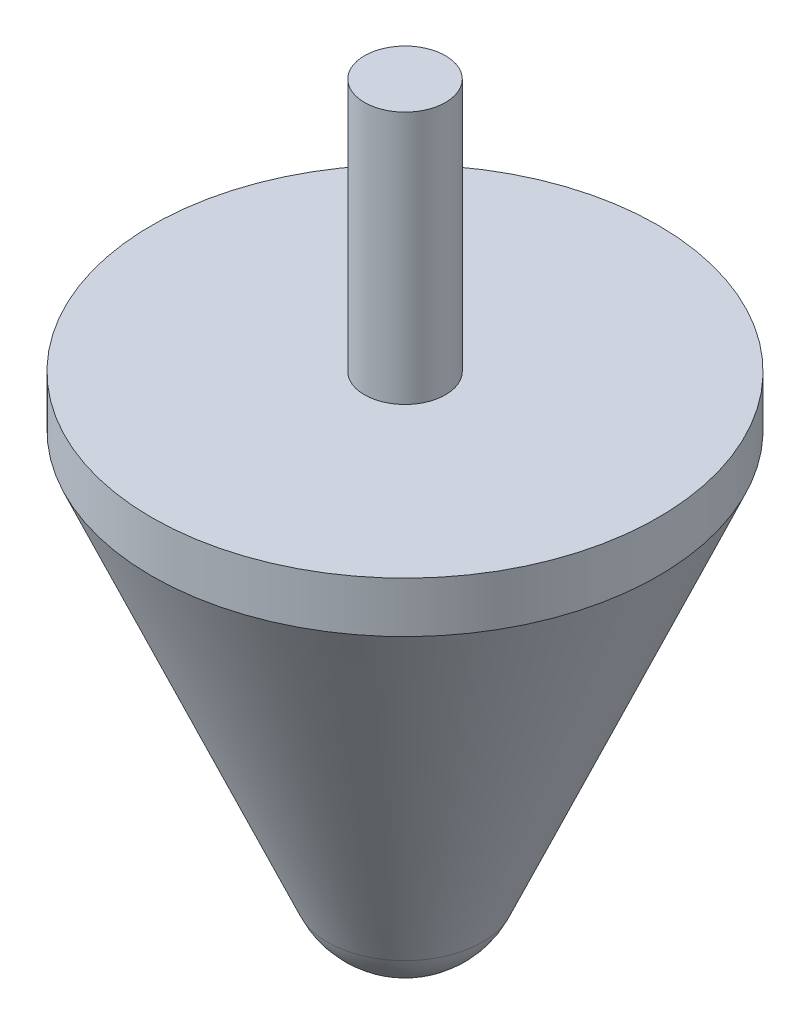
ISO-10303-21;
HEADER;
FILE_DESCRIPTION(('STEP AP214'),'2;1');
FILE_NAME('part.step','',(''),(''),'','','');
FILE_SCHEMA(('AUTOMOTIVE_DESIGN { 1 0 10303 214 1 1 1 1 }'));
ENDSEC;
DATA;
#1=APPLICATION_CONTEXT('core data for automotive mechanical design processes');
#2=APPLICATION_PROTOCOL_DEFINITION('international standard','automotive_design',2000,#1);
#3=PRODUCT_CONTEXT('',#1,'mechanical');
#4=PRODUCT('Part','Part','',(#3));
#5=PRODUCT_RELATED_PRODUCT_CATEGORY('part','',(#4));
#6=PRODUCT_DEFINITION_FORMATION('','',#4);
#7=PRODUCT_DEFINITION_CONTEXT('part definition',#1,'design');
#8=PRODUCT_DEFINITION('design','',#6,#7);
#9=PRODUCT_DEFINITION_SHAPE('','',#8);
#10=(LENGTH_UNIT() NAMED_UNIT(*) SI_UNIT(.MILLI.,.METRE.));
#11=(NAMED_UNIT(*) PLANE_ANGLE_UNIT() SI_UNIT($,.RADIAN.));
#12=(NAMED_UNIT(*) SI_UNIT($,.STERADIAN.) SOLID_ANGLE_UNIT());
#13=UNCERTAINTY_MEASURE_WITH_UNIT(LENGTH_MEASURE(1.E-05),#10,'distance_accuracy_value','');
#14=(GEOMETRIC_REPRESENTATION_CONTEXT(3) GLOBAL_UNCERTAINTY_ASSIGNED_CONTEXT((#13)) GLOBAL_UNIT_ASSIGNED_CONTEXT((#10,
#11,#12)) REPRESENTATION_CONTEXT('',''));
#15=CARTESIAN_POINT('',(0.,0.,0.));
#16=DIRECTION('',(0.,0.,1.));
#17=DIRECTION('',(1.,0.,0.));
#18=AXIS2_PLACEMENT_3D('',#15,#16,#17);
#19=CARTESIAN_POINT('',(2.49999999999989,75.,0.));
#20=DIRECTION('',(0.,1.,0.));
#21=DIRECTION('',(0.,0.,0.999999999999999));
#22=AXIS2_PLACEMENT_3D('',#19,#20,#21);
#23=PLANE('',#22);
#24=CARTESIAN_POINT('',(-1.11022302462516E-13,75.,1.11022302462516E-13));
#25=DIRECTION('',(0.,1.,0.));
#26=DIRECTION('',(0.,0.,0.999999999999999));
#27=AXIS2_PLACEMENT_3D('',#24,#25,#26);
#28=CIRCLE('',#27,4.);
#29=CARTESIAN_POINT('',(-1.1230124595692E-13,75.,4.0000000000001));
#30=VERTEX_POINT('',#29);
#31=EDGE_CURVE('E29',#30,#30,#28,.F.);
#32=ORIENTED_EDGE('',*,*,#31,.F.);
#33=EDGE_LOOP('',(#32));
#34=FACE_BOUND('',#33,.T.);
#35=ADVANCED_FACE('F25',(#34),#23,.T.);
#36=CARTESIAN_POINT('',(-1.11022302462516E-13,-25.1575911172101,1.11022302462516E-13));
#37=DIRECTION('',(0.,1.,0.));
#38=DIRECTION('',(0.,0.,0.999999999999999));
#39=AXIS2_PLACEMENT_3D('',#36,#37,#38);
#40=CYLINDRICAL_SURFACE('',#39,4.);
#41=CARTESIAN_POINT('',(0.,49.9999999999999,0.));
#42=DIRECTION('',(0.,1.,0.));
#43=DIRECTION('',(0.,0.,0.999999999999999));
#44=AXIS2_PLACEMENT_3D('',#41,#42,#43);
#45=CIRCLE('',#44,4.);
#46=CARTESIAN_POINT('',(-1.11954301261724E-13,49.9999999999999,4.0000000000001));
#47=VERTEX_POINT('',#46);
#48=EDGE_CURVE('E42',#47,#47,#45,.F.);
#49=CARTESIAN_POINT('',(-1.1230124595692E-13,75.,4.0000000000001));
#50=CARTESIAN_POINT('',(-1.12297631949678E-13,74.7395833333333,4.0000000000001));
#51=CARTESIAN_POINT('',(-1.12294017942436E-13,74.4791666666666,4.0000000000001));
#52=CARTESIAN_POINT('',(-1.12286789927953E-13,73.9583333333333,4.0000000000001));
#53=CARTESIAN_POINT('',(-1.12283175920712E-13,73.6979166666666,4.0000000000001));
#54=CARTESIAN_POINT('',(-1.12275947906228E-13,73.1770833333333,4.0000000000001));
#55=CARTESIAN_POINT('',(-1.12272333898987E-13,72.9166666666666,4.0000000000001));
#56=CARTESIAN_POINT('',(-1.12265105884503E-13,72.3958333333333,4.0000000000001));
#57=CARTESIAN_POINT('',(-1.12261491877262E-13,72.1354166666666,4.0000000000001));
#58=CARTESIAN_POINT('',(-1.12254263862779E-13,71.6145833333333,4.0000000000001));
#59=CARTESIAN_POINT('',(-1.12250649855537E-13,71.3541666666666,4.0000000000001));
#60=CARTESIAN_POINT('',(-1.12243421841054E-13,70.8333333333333,4.0000000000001));
#61=CARTESIAN_POINT('',(-1.12239807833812E-13,70.5729166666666,4.0000000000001));
#62=CARTESIAN_POINT('',(-1.12232579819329E-13,70.0520833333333,4.0000000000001));
#63=CARTESIAN_POINT('',(-1.12228965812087E-13,69.7916666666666,4.0000000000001));
#64=CARTESIAN_POINT('',(-1.12221737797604E-13,69.2708333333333,4.0000000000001));
#65=CARTESIAN_POINT('',(-1.12218123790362E-13,69.0104166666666,4.0000000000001));
#66=CARTESIAN_POINT('',(-1.12210895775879E-13,68.4895833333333,4.0000000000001));
#67=CARTESIAN_POINT('',(-1.12207281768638E-13,68.2291666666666,4.0000000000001));
#68=CARTESIAN_POINT('',(-1.12200053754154E-13,67.7083333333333,4.0000000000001));
#69=CARTESIAN_POINT('',(-1.12196439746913E-13,67.4479166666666,4.0000000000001));
#70=CARTESIAN_POINT('',(-1.12189211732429E-13,66.9270833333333,4.0000000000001));
#71=CARTESIAN_POINT('',(-1.12185597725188E-13,66.6666666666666,4.0000000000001));
#72=CARTESIAN_POINT('',(-1.12178369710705E-13,66.1458333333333,4.0000000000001));
#73=CARTESIAN_POINT('',(-1.12174755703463E-13,65.8854166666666,4.0000000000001));
#74=CARTESIAN_POINT('',(-1.1216752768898E-13,65.3645833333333,4.0000000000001));
#75=CARTESIAN_POINT('',(-1.12163913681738E-13,65.1041666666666,4.0000000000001));
#76=CARTESIAN_POINT('',(-1.12156685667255E-13,64.5833333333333,4.0000000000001));
#77=CARTESIAN_POINT('',(-1.12153071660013E-13,64.3229166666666,4.0000000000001));
#78=CARTESIAN_POINT('',(-1.1214584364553E-13,63.8020833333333,4.0000000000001));
#79=CARTESIAN_POINT('',(-1.12142229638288E-13,63.5416666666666,4.0000000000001));
#80=CARTESIAN_POINT('',(-1.12135001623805E-13,63.0208333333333,4.0000000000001));
#81=CARTESIAN_POINT('',(-1.12131387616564E-13,62.7604166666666,4.0000000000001));
#82=CARTESIAN_POINT('',(-1.1212415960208E-13,62.2395833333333,4.0000000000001));
#83=CARTESIAN_POINT('',(-1.12120545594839E-13,61.9791666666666,4.0000000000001));
#84=CARTESIAN_POINT('',(-1.12113317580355E-13,61.4583333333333,4.0000000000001));
#85=CARTESIAN_POINT('',(-1.12109703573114E-13,61.1979166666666,4.0000000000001));
#86=CARTESIAN_POINT('',(-1.12102475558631E-13,60.6770833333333,4.0000000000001));
#87=CARTESIAN_POINT('',(-1.12098861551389E-13,60.4166666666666,4.0000000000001));
#88=CARTESIAN_POINT('',(-1.12091633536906E-13,59.8958333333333,4.0000000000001));
#89=CARTESIAN_POINT('',(-1.12088019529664E-13,59.6354166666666,4.0000000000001));
#90=CARTESIAN_POINT('',(-1.12080791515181E-13,59.1145833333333,4.0000000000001));
#91=CARTESIAN_POINT('',(-1.12077177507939E-13,58.8541666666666,4.0000000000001));
#92=CARTESIAN_POINT('',(-1.12069949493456E-13,58.3333333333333,4.0000000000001));
#93=CARTESIAN_POINT('',(-1.12066335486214E-13,58.0729166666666,4.0000000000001));
#94=CARTESIAN_POINT('',(-1.12059107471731E-13,57.5520833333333,4.0000000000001));
#95=CARTESIAN_POINT('',(-1.1205549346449E-13,57.2916666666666,4.0000000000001));
#96=CARTESIAN_POINT('',(-1.12048265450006E-13,56.7708333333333,4.0000000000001));
#97=CARTESIAN_POINT('',(-1.12044651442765E-13,56.5104166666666,4.0000000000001));
#98=CARTESIAN_POINT('',(-1.12037423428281E-13,55.9895833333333,4.0000000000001));
#99=CARTESIAN_POINT('',(-1.1203380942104E-13,55.7291666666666,4.0000000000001));
#100=CARTESIAN_POINT('',(-1.12026581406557E-13,55.2083333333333,4.0000000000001));
#101=CARTESIAN_POINT('',(-1.12022967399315E-13,54.9479166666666,4.0000000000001));
#102=CARTESIAN_POINT('',(-1.12015739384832E-13,54.4270833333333,4.0000000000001));
#103=CARTESIAN_POINT('',(-1.1201212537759E-13,54.1666666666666,4.0000000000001));
#104=CARTESIAN_POINT('',(-1.12004897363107E-13,53.6458333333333,4.0000000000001));
#105=CARTESIAN_POINT('',(-1.12001283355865E-13,53.3854166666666,4.0000000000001));
#106=CARTESIAN_POINT('',(-1.11994055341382E-13,52.8645833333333,4.0000000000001));
#107=CARTESIAN_POINT('',(-1.1199044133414E-13,52.6041666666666,4.0000000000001));
#108=CARTESIAN_POINT('',(-1.11983213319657E-13,52.0833333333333,4.0000000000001));
#109=CARTESIAN_POINT('',(-1.11979599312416E-13,51.8229166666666,4.0000000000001));
#110=CARTESIAN_POINT('',(-1.11972371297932E-13,51.3020833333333,4.0000000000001));
#111=CARTESIAN_POINT('',(-1.11968757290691E-13,51.0416666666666,4.0000000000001));
#112=CARTESIAN_POINT('',(-1.11961529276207E-13,50.5208333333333,4.0000000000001));
#113=CARTESIAN_POINT('',(-1.11957915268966E-13,50.2604166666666,4.0000000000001));
#114=CARTESIAN_POINT('',(-1.11954301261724E-13,49.9999999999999,4.0000000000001));
#115=B_SPLINE_CURVE_WITH_KNOTS('',3,(#49,#50,#51,#52,#53,#54,#55,#56,#57,#58,#59,#60,#61,#62,
#63,#64,#65,#66,#67,#68,#69,#70,#71,#72,#73,#74,#75,#76,#77,#78,#79,#80,#81,#82,#83,#84,#85,#86,
#87,#88,#89,#90,#91,#92,#93,#94,#95,#96,#97,#98,#99,#100,#101,#102,#103,#104,#105,#106,#107,
#108,#109,#110,#111,#112,#113,#114),.UNSPECIFIED.,.F.,.F.,(4,2,2,2,2,2,2,2,2,2,2,2,2,2,2,2,2,2,
2,2,2,2,2,2,2,2,2,2,2,2,2,2,4),(0.,0.781249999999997,1.56250000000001,2.34375000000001,3.125,
3.90625000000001,4.68750000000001,5.46875000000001,6.25000000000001,7.03125000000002,
7.81250000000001,8.59375000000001,9.37500000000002,10.15625,10.9375,11.71875,12.5,13.28125,
14.0625,14.84375,15.625,16.40625,17.1875,17.96875,18.75,19.53125,20.3125,21.09375,21.875,
22.65625,23.4375,24.21875,25.),.UNSPECIFIED.);
#116=EDGE_CURVE('BSEAM49',#30,#47,#115,.T.);
#117=ORIENTED_EDGE('',*,*,#31,.T.);
#118=ORIENTED_EDGE('',*,*,#48,.F.);
#119=ORIENTED_EDGE('',*,*,#116,.T.);
#120=ORIENTED_EDGE('',*,*,#116,.F.);
#121=EDGE_LOOP('',(#117,#119,#118,#120));
#122=FACE_BOUND('',#121,.T.);
#123=ADVANCED_FACE('F49',(#122),#40,.T.);
#124=CARTESIAN_POINT('',(14.9999999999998,50.,0.));
#125=DIRECTION('',(0.,1.,0.));
#126=DIRECTION('',(0.,0.,0.999999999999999));
#127=AXIS2_PLACEMENT_3D('',#124,#125,#126);
#128=PLANE('',#127);
#129=ORIENTED_EDGE('',*,*,#48,.T.);
#130=EDGE_LOOP('',(#129));
#131=FACE_BOUND('',#130,.T.);
#132=CARTESIAN_POINT('',(0.,49.9999999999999,0.));
#133=DIRECTION('',(0.,-1.,0.));
#134=DIRECTION('',(0.,0.,-0.999999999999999));
#135=AXIS2_PLACEMENT_3D('',#132,#133,#134);
#136=CIRCLE('',#135,25.);
#137=CARTESIAN_POINT('',(0.,49.9999999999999,-25.));
#138=VERTEX_POINT('',#137);
#139=EDGE_CURVE('E38',#138,#138,#136,.T.);
#140=ORIENTED_EDGE('',*,*,#139,.F.);
#141=EDGE_LOOP('',(#140));
#142=FACE_BOUND('',#141,.T.);
#143=ADVANCED_FACE('F57',(#131,#142),#128,.T.);
#144=CARTESIAN_POINT('',(0.,8.33333333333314,0.));
#145=DIRECTION('',(1.,0.,0.));
#146=DIRECTION('',(0.,-0.385334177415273,0.922777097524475));
#147=AXIS2_PLACEMENT_3D('',#144,#145,#146);
#148=SPHERICAL_SURFACE('',#147,8.33333333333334);
#149=CARTESIAN_POINT('',(0.,8.33333333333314,0.));
#150=DIRECTION('',(0.,1.,0.));
#151=DIRECTION('',(0.,0.,1.));
#152=AXIS2_PLACEMENT_3D('',#149,#150,#151);
#153=SPHERICAL_SURFACE('',#152,8.33333333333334);
#154=CARTESIAN_POINT('',(-1.11022302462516E-13,5.01526910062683,1.11022302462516E-13));
#155=DIRECTION('',(0.,1.,0.));
#156=DIRECTION('',(0.,0.,0.999999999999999));
#157=AXIS2_PLACEMENT_3D('',#154,#155,#156);
#158=CIRCLE('',#157,7.64427198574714);
#159=CARTESIAN_POINT('',(-1.10810131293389E-13,5.01526910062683,7.64427198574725));
#160=VERTEX_POINT('',#159);
#161=EDGE_CURVE('E33',#160,#160,#158,.T.);
#162=ORIENTED_EDGE('',*,*,#161,.F.);
#163=EDGE_LOOP('',(#162));
#164=FACE_BOUND('',#163,.T.);
#165=ADVANCED_FACE('F27',(#164),#153,.T.);
#166=CARTESIAN_POINT('',(0.,47.4999999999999,0.));
#167=DIRECTION('',(0.,-1.,0.));
#168=DIRECTION('',(0.,0.,-0.999999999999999));
#169=AXIS2_PLACEMENT_3D('',#166,#167,#168);
#170=CYLINDRICAL_SURFACE('',#169,25.);
#171=CARTESIAN_POINT('',(0.,44.9999999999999,0.));
#172=DIRECTION('',(0.,1.,0.));
#173=DIRECTION('',(0.,0.,0.999999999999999));
#174=AXIS2_PLACEMENT_3D('',#171,#172,#173);
#175=CIRCLE('',#174,25.);
#176=CARTESIAN_POINT('',(0.,44.9999999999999,-25.));
#177=VERTEX_POINT('',#176);
#178=EDGE_CURVE('E12',#177,#177,#175,.F.);
#179=CARTESIAN_POINT('',(0.,44.9999999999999,-25.));
#180=CARTESIAN_POINT('',(0.,45.0520833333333,-25.));
#181=CARTESIAN_POINT('',(0.,45.1041666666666,-25.));
#182=CARTESIAN_POINT('',(0.,45.2083333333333,-25.));
#183=CARTESIAN_POINT('',(0.,45.2604166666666,-25.));
#184=CARTESIAN_POINT('',(0.,45.3645833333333,-25.));
#185=CARTESIAN_POINT('',(0.,45.4166666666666,-25.));
#186=CARTESIAN_POINT('',(0.,45.5208333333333,-25.));
#187=CARTESIAN_POINT('',(0.,45.5729166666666,-25.));
#188=CARTESIAN_POINT('',(0.,45.6770833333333,-25.));
#189=CARTESIAN_POINT('',(0.,45.7291666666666,-25.));
#190=CARTESIAN_POINT('',(0.,45.8333333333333,-25.));
#191=CARTESIAN_POINT('',(0.,45.8854166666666,-25.));
#192=CARTESIAN_POINT('',(0.,45.9895833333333,-25.));
#193=CARTESIAN_POINT('',(0.,46.0416666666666,-25.));
#194=CARTESIAN_POINT('',(0.,46.1458333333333,-25.));
#195=CARTESIAN_POINT('',(0.,46.1979166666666,-25.));
#196=CARTESIAN_POINT('',(0.,46.3020833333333,-25.));
#197=CARTESIAN_POINT('',(0.,46.3541666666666,-25.));
#198=CARTESIAN_POINT('',(0.,46.4583333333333,-25.));
#199=CARTESIAN_POINT('',(0.,46.5104166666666,-25.));
#200=CARTESIAN_POINT('',(0.,46.6145833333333,-25.));
#201=CARTESIAN_POINT('',(0.,46.6666666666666,-25.));
#202=CARTESIAN_POINT('',(0.,46.7708333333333,-25.));
#203=CARTESIAN_POINT('',(0.,46.8229166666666,-25.));
#204=CARTESIAN_POINT('',(0.,46.9270833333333,-25.));
#205=CARTESIAN_POINT('',(0.,46.9791666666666,-25.));
#206=CARTESIAN_POINT('',(0.,47.0833333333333,-25.));
#207=CARTESIAN_POINT('',(0.,47.1354166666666,-25.));
#208=CARTESIAN_POINT('',(0.,47.2395833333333,-25.));
#209=CARTESIAN_POINT('',(0.,47.2916666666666,-25.));
#210=CARTESIAN_POINT('',(0.,47.3958333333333,-25.));
#211=CARTESIAN_POINT('',(0.,47.4479166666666,-25.));
#212=CARTESIAN_POINT('',(0.,47.5520833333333,-25.));
#213=CARTESIAN_POINT('',(0.,47.6041666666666,-25.));
#214=CARTESIAN_POINT('',(0.,47.7083333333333,-25.));
#215=CARTESIAN_POINT('',(0.,47.7604166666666,-25.));
#216=CARTESIAN_POINT('',(0.,47.8645833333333,-25.));
#217=CARTESIAN_POINT('',(0.,47.9166666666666,-25.));
#218=CARTESIAN_POINT('',(0.,48.0208333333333,-25.));
#219=CARTESIAN_POINT('',(0.,48.0729166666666,-25.));
#220=CARTESIAN_POINT('',(0.,48.1770833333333,-25.));
#221=CARTESIAN_POINT('',(0.,48.2291666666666,-25.));
#222=CARTESIAN_POINT('',(0.,48.3333333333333,-25.));
#223=CARTESIAN_POINT('',(0.,48.3854166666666,-25.));
#224=CARTESIAN_POINT('',(0.,48.4895833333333,-25.));
#225=CARTESIAN_POINT('',(0.,48.5416666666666,-25.));
#226=CARTESIAN_POINT('',(0.,48.6458333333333,-25.));
#227=CARTESIAN_POINT('',(0.,48.6979166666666,-25.));
#228=CARTESIAN_POINT('',(0.,48.8020833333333,-25.));
#229=CARTESIAN_POINT('',(0.,48.8541666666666,-25.));
#230=CARTESIAN_POINT('',(0.,48.9583333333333,-25.));
#231=CARTESIAN_POINT('',(0.,49.0104166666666,-25.));
#232=CARTESIAN_POINT('',(0.,49.1145833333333,-25.));
#233=CARTESIAN_POINT('',(0.,49.1666666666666,-25.));
#234=CARTESIAN_POINT('',(0.,49.2708333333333,-25.));
#235=CARTESIAN_POINT('',(0.,49.3229166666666,-25.));
#236=CARTESIAN_POINT('',(0.,49.4270833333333,-25.));
#237=CARTESIAN_POINT('',(0.,49.4791666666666,-25.));
#238=CARTESIAN_POINT('',(0.,49.5833333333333,-25.));
#239=CARTESIAN_POINT('',(0.,49.6354166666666,-25.));
#240=CARTESIAN_POINT('',(0.,49.7395833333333,-25.));
#241=CARTESIAN_POINT('',(0.,49.7916666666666,-25.));
#242=CARTESIAN_POINT('',(0.,49.8958333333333,-25.));
#243=CARTESIAN_POINT('',(0.,49.9479166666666,-25.));
#244=CARTESIAN_POINT('',(0.,49.9999999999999,-25.));
#245=B_SPLINE_CURVE_WITH_KNOTS('',3,(#179,#180,#181,#182,#183,#184,#185,#186,#187,#188,#189,
#190,#191,#192,#193,#194,#195,#196,#197,#198,#199,#200,#201,#202,#203,#204,#205,#206,#207,#208,
#209,#210,#211,#212,#213,#214,#215,#216,#217,#218,#219,#220,#221,#222,#223,#224,#225,#226,#227,
#228,#229,#230,#231,#232,#233,#234,#235,#236,#237,#238,#239,#240,#241,#242,#243,#244),
.UNSPECIFIED.,.F.,.F.,(4,2,2,2,2,2,2,2,2,2,2,2,2,2,2,2,2,2,2,2,2,2,2,2,2,2,2,2,2,2,2,2,4),(0.,
0.156250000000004,0.3125,0.468750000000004,0.625000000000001,0.781250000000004,
0.937500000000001,1.09375,1.25,1.40625,1.5625,1.71875,1.875,2.03125000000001,2.1875,
2.34375000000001,2.5,2.65625000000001,2.8125,2.96875000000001,3.125,3.28125000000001,3.4375,
3.59375000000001,3.75,3.90625000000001,4.0625,4.21875000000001,4.37500000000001,
4.53125000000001,4.6875,4.84375000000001,5.),.UNSPECIFIED.);
#246=EDGE_CURVE('BSEAM61',#177,#138,#245,.T.);
#247=ORIENTED_EDGE('',*,*,#178,.F.);
#248=ORIENTED_EDGE('',*,*,#139,.T.);
#249=ORIENTED_EDGE('',*,*,#246,.T.);
#250=ORIENTED_EDGE('',*,*,#246,.F.);
#251=EDGE_LOOP('',(#247,#249,#248,#250));
#252=FACE_BOUND('',#251,.T.);
#253=ADVANCED_FACE('F61',(#252),#170,.T.);
#254=CARTESIAN_POINT('',(0.,44.9999999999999,0.));
#255=DIRECTION('',(0.,1.,0.));
#256=DIRECTION('',(0.,0.,0.999999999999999));
#257=AXIS2_PLACEMENT_3D('',#254,#255,#256);
#258=CONICAL_SURFACE('',#257,25.,0.409518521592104);
#259=ORIENTED_EDGE('',*,*,#178,.T.);
#260=EDGE_LOOP('',(#259));
#261=FACE_BOUND('',#260,.T.);
#262=ORIENTED_EDGE('',*,*,#161,.T.);
#263=EDGE_LOOP('',(#262));
#264=FACE_BOUND('',#263,.T.);
#265=ADVANCED_FACE('F59',(#261,#264),#258,.T.);
#266=CLOSED_SHELL('',(#35,#123,#143,#165,#253,#265));
#267=MANIFOLD_SOLID_BREP('B1',#266);
#268=ADVANCED_BREP_SHAPE_REPRESENTATION('',(#18,#267),#14);
#269=SHAPE_DEFINITION_REPRESENTATION(#9,#268);
ENDSEC;
END-ISO-10303-21;
